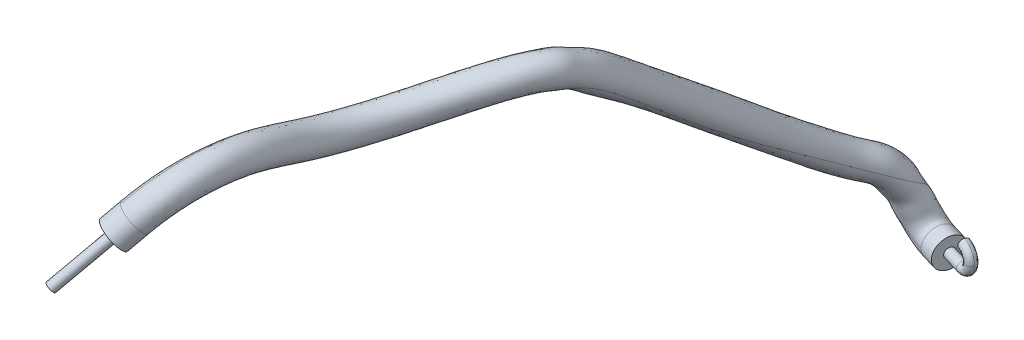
ISO-10303-21;
HEADER;
FILE_DESCRIPTION(('STEP AP214'),'2;1');
FILE_NAME('part.step','',(''),(''),'','','');
FILE_SCHEMA(('AUTOMOTIVE_DESIGN { 1 0 10303 214 1 1 1 1 }'));
ENDSEC;
DATA;
#1=APPLICATION_CONTEXT('core data for automotive mechanical design processes');
#2=APPLICATION_PROTOCOL_DEFINITION('international standard','automotive_design',2000,#1);
#3=PRODUCT_CONTEXT('',#1,'mechanical');
#4=PRODUCT('Part','Part','',(#3));
#5=PRODUCT_RELATED_PRODUCT_CATEGORY('part','',(#4));
#6=PRODUCT_DEFINITION_FORMATION('','',#4);
#7=PRODUCT_DEFINITION_CONTEXT('part definition',#1,'design');
#8=PRODUCT_DEFINITION('design','',#6,#7);
#9=PRODUCT_DEFINITION_SHAPE('','',#8);
#10=(LENGTH_UNIT() NAMED_UNIT(*) SI_UNIT(.MILLI.,.METRE.));
#11=(NAMED_UNIT(*) PLANE_ANGLE_UNIT() SI_UNIT($,.RADIAN.));
#12=(NAMED_UNIT(*) SI_UNIT($,.STERADIAN.) SOLID_ANGLE_UNIT());
#13=UNCERTAINTY_MEASURE_WITH_UNIT(LENGTH_MEASURE(1.E-05),#10,'distance_accuracy_value','');
#14=(GEOMETRIC_REPRESENTATION_CONTEXT(3) GLOBAL_UNCERTAINTY_ASSIGNED_CONTEXT((#13)) GLOBAL_UNIT_ASSIGNED_CONTEXT((#10,
#11,#12)) REPRESENTATION_CONTEXT('',''));
#15=CARTESIAN_POINT('',(0.,0.,0.));
#16=DIRECTION('',(0.,0.,1.));
#17=DIRECTION('',(1.,0.,0.));
#18=AXIS2_PLACEMENT_3D('',#15,#16,#17);
#19=CARTESIAN_POINT('',(-13.62070651,59.58278314,32.204603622));
#20=DIRECTION('',(-0.439842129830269,-0.670380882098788,0.597602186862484));
#21=DIRECTION('',(0.,-0.66542562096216,-0.746464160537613));
#22=AXIS2_PLACEMENT_3D('',#19,#20,#21);
#23=PLANE('',#22);
#24=CARTESIAN_POINT('',(-13.3934935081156,59.3313638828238,32.0897967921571));
#25=DIRECTION('',(0.439842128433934,0.6703808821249,-0.597602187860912));
#26=DIRECTION('',(0.,0.66542562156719,0.746464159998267));
#27=AXIS2_PLACEMENT_3D('',#24,#25,#26);
#28=CIRCLE('',#27,0.249999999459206);
#29=CARTESIAN_POINT('',(-13.3934935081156,59.4977202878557,32.276412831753));
#30=VERTEX_POINT('',#29);
#31=EDGE_CURVE('E22',#30,#30,#28,.F.);
#32=ORIENTED_EDGE('',*,*,#31,.T.);
#33=EDGE_LOOP('',(#32));
#34=FACE_BOUND('',#33,.T.);
#35=ADVANCED_FACE('F17',(#34),#23,.T.);
#36=CARTESIAN_POINT('',(-13.3934935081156,59.3313638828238,32.0897967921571));
#37=DIRECTION('',(0.439842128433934,0.6703808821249,-0.597602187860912));
#38=DIRECTION('',(0.,0.66542562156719,0.746464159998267));
#39=AXIS2_PLACEMENT_3D('',#36,#37,#38);
#40=CYLINDRICAL_SURFACE('',#39,0.249999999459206);
#41=ORIENTED_EDGE('',*,*,#31,.F.);
#42=EDGE_LOOP('',(#41));
#43=FACE_BOUND('',#42,.T.);
#44=CARTESIAN_POINT('',(-12.0739671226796,61.3425065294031,30.296990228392));
#45=DIRECTION('',(0.439842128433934,0.6703808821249,-0.597602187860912));
#46=DIRECTION('',(0.,0.66542562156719,0.746464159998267));
#47=AXIS2_PLACEMENT_3D('',#44,#45,#46);
#48=CIRCLE('',#47,0.249999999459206);
#49=CARTESIAN_POINT('',(-12.0739671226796,61.508862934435,30.4836062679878));
#50=VERTEX_POINT('',#49);
#51=EDGE_CURVE('E96',#50,#50,#48,.F.);
#52=ORIENTED_EDGE('',*,*,#51,.T.);
#53=EDGE_LOOP('',(#52));
#54=FACE_BOUND('',#53,.T.);
#55=ADVANCED_FACE('F244',(#43,#54),#40,.T.);
#56=CARTESIAN_POINT('',(-11.88022137,61.971360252,31.145027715));
#57=DIRECTION('',(0.439842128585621,0.670380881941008,-0.597602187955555));
#58=DIRECTION('',(0.494444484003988,-0.736257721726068,-0.46200564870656));
#59=AXIS2_PLACEMENT_3D('',#56,#57,#58);
#60=PLANE('',#59);
#61=ORIENTED_EDGE('',*,*,#51,.F.);
#62=EDGE_LOOP('',(#61));
#63=FACE_BOUND('',#62,.T.);
#64=CARTESIAN_POINT('',(-12.0739671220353,61.3425065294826,30.2969902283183));
#65=DIRECTION('',(-0.439842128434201,-0.6703808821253,0.597602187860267));
#66=DIRECTION('',(0.,-0.665425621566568,-0.746464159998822));
#67=AXIS2_PLACEMENT_3D('',#64,#65,#66);
#68=CIRCLE('',#67,0.75000000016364);
#69=CARTESIAN_POINT('',(-12.0739671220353,60.8434373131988,29.737142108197));
#70=VERTEX_POINT('',#69);
#71=EDGE_CURVE('E75',#70,#70,#68,.T.);
#72=ORIENTED_EDGE('',*,*,#71,.T.);
#73=EDGE_LOOP('',(#72));
#74=FACE_BOUND('',#73,.T.);
#75=ADVANCED_FACE('F246',(#63,#74),#60,.F.);
#76=CARTESIAN_POINT('',(-11.6341249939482,62.012887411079,29.6993880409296));
#77=DIRECTION('',(-0.439842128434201,-0.6703808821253,0.597602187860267));
#78=DIRECTION('',(0.,-0.665425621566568,-0.746464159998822));
#79=AXIS2_PLACEMENT_3D('',#76,#77,#78);
#80=CYLINDRICAL_SURFACE('',#79,0.75000000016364);
#81=ORIENTED_EDGE('',*,*,#71,.F.);
#82=EDGE_LOOP('',(#81));
#83=FACE_BOUND('',#82,.T.);
#84=CARTESIAN_POINT('',(-11.634124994,62.012887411,29.6993880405));
#85=DIRECTION('',(-0.43984212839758,-0.670380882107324,0.597602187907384));
#86=DIRECTION('',(0.,-0.665425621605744,-0.746464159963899));
#87=AXIS2_PLACEMENT_3D('',#84,#85,#86);
#88=CIRCLE('',#87,0.749999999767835);
#89=CARTESIAN_POINT('',(-11.2632916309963,61.4606941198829,29.3528838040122));
#90=VERTEX_POINT('',#89);
#91=CARTESIAN_POINT('',(-11.634124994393,62.5119566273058,30.2592361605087));
#92=VERTEX_POINT('',#91);
#93=EDGE_CURVE('E69',#90,#92,#88,.T.);
#94=ORIENTED_EDGE('',*,*,#93,.T.);
#95=CARTESIAN_POINT('',(-11.6341249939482,62.012887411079,29.6993880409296));
#96=DIRECTION('',(-0.439842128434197,-0.670380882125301,0.597602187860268));
#97=DIRECTION('',(-6.90882536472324E-11,-0.66542562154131,-0.746464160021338));
#98=AXIS2_PLACEMENT_3D('',#95,#96,#97);
#99=CIRCLE('',#98,0.749999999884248);
#100=CARTESIAN_POINT('',(-12.0049583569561,62.5650807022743,30.0458922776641));
#101=VERTEX_POINT('',#100);
#102=EDGE_CURVE('E70',#101,#92,#99,.F.);
#103=ORIENTED_EDGE('',*,*,#102,.F.);
#104=CARTESIAN_POINT('',(-11.6341249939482,62.012887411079,29.6993880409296));
#105=DIRECTION('',(-0.439842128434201,-0.6703808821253,0.597602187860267));
#106=DIRECTION('',(0.,-0.665425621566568,-0.746464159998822));
#107=AXIS2_PLACEMENT_3D('',#104,#105,#106);
#108=CIRCLE('',#107,0.75000000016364);
#109=EDGE_CURVE('E65',#101,#90,#108,.T.);
#110=ORIENTED_EDGE('',*,*,#109,.T.);
#111=EDGE_LOOP('',(#94,#103,#110));
#112=FACE_BOUND('',#111,.T.);
#113=ADVANCED_FACE('F67',(#83,#112),#80,.T.);
#114=CARTESIAN_POINT('',(-1.886410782,50.644767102,-1.243295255));
#115=CARTESIAN_POINT('',(-1.968521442,50.650525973,-1.263767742));
#116=CARTESIAN_POINT('',(-2.164274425,50.698482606,-1.307429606));
#117=CARTESIAN_POINT('',(-2.395307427,50.804358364,-1.341371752));
#118=CARTESIAN_POINT('',(-2.60002574,50.958180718,-1.353450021));
#119=CARTESIAN_POINT('',(-2.764043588,51.145470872,-1.341487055));
#120=CARTESIAN_POINT('',(-2.889957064,51.359684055,-1.308995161));
#121=CARTESIAN_POINT('',(-3.038226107,51.745795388,-1.215105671));
#122=CARTESIAN_POINT('',(-3.054058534,52.391035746,-1.037295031));
#123=CARTESIAN_POINT('',(-2.657574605,53.119943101,0.027679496));
#124=CARTESIAN_POINT('',(-2.939590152,53.507335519,0.666316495));
#125=CARTESIAN_POINT('',(-3.258043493,53.855859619,1.285390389));
#126=CARTESIAN_POINT('',(-3.406377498,53.994100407,1.543505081));
#127=CARTESIAN_POINT('',(-3.762232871,54.498445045,2.368195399));
#128=CARTESIAN_POINT('',(-4.2177831,55.259491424,3.595532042));
#129=CARTESIAN_POINT('',(-5.305234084,56.958877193,6.503265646));
#130=CARTESIAN_POINT('',(-6.16409283,59.354108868,9.521605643));
#131=CARTESIAN_POINT('',(-6.332374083,61.055563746,11.57068465));
#132=CARTESIAN_POINT('',(-6.617683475,61.556587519,12.617111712));
#133=CARTESIAN_POINT('',(-7.01101853,61.539806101,13.180845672));
#134=CARTESIAN_POINT('',(-7.193153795,61.610985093,13.578655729));
#135=CARTESIAN_POINT('',(-7.32198001,61.699015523,13.953358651));
#136=CARTESIAN_POINT('',(-7.538863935,61.708319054,14.519593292));
#137=CARTESIAN_POINT('',(-8.112263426,61.634596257,16.011469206));
#138=CARTESIAN_POINT('',(-9.277087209,61.046386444,17.622369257));
#139=CARTESIAN_POINT('',(-9.960297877,61.006824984,19.803813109));
#140=CARTESIAN_POINT('',(-10.226645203,61.105727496,20.99034474));
#141=CARTESIAN_POINT('',(-10.328455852,61.311084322,21.972941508));
#142=CARTESIAN_POINT('',(-10.363296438,61.57320866,22.890906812));
#143=CARTESIAN_POINT('',(-10.347622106,61.876946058,23.765989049));
#144=CARTESIAN_POINT('',(-10.292472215,62.164861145,24.621700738));
#145=CARTESIAN_POINT('',(-10.302037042,62.396826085,25.651947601));
#146=CARTESIAN_POINT('',(-10.396533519,62.480983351,26.544433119));
#147=CARTESIAN_POINT('',(-10.540196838,62.41176999,27.541449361));
#148=CARTESIAN_POINT('',(-10.703305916,62.24714593,28.22390293));
#149=CARTESIAN_POINT('',(-10.941106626,61.933818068,28.848861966));
#150=CARTESIAN_POINT('',(-11.125176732,61.671200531,29.165230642));
#151=CARTESIAN_POINT('',(-11.263291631,61.46069412,29.352883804));
#152=CARTESIAN_POINT('',(-1.787593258,52.141305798,-1.218657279));
#153=CARTESIAN_POINT('',(-1.830755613,52.14433301,-1.229418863));
#154=CARTESIAN_POINT('',(-1.774539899,52.157408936,-1.180637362));
#155=CARTESIAN_POINT('',(-1.742076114,52.151159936,-1.149151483));
#156=CARTESIAN_POINT('',(-1.680865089,52.131047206,-1.102398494));
#157=CARTESIAN_POINT('',(-1.65076935,52.119187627,-1.05325366));
#158=CARTESIAN_POINT('',(-1.641892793,52.138497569,-0.984042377));
#159=CARTESIAN_POINT('',(-1.666554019,52.22574009,-0.809651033));
#160=CARTESIAN_POINT('',(-1.562469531,52.526239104,-0.338630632));
#161=CARTESIAN_POINT('',(-2.459759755,52.327405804,1.667353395));
#162=CARTESIAN_POINT('',(-3.190304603,52.409334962,1.702648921));
#163=CARTESIAN_POINT('',(-3.662047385,52.554964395,1.930124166));
#164=CARTESIAN_POINT('',(-3.691969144,52.667746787,2.177374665));
#165=CARTESIAN_POINT('',(-3.995436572,53.183100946,3.05697991));
#166=CARTESIAN_POINT('',(-4.643117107,54.013147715,4.397417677));
#167=CARTESIAN_POINT('',(-6.462574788,55.972968,6.892387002));
#168=CARTESIAN_POINT('',(-7.227574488,58.475208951,9.960585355));
#169=CARTESIAN_POINT('',(-6.999909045,59.726745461,12.341897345));
#170=CARTESIAN_POINT('',(-7.518258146,60.438676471,13.124430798));
#171=CARTESIAN_POINT('',(-8.389478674,60.913287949,13.201476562));
#172=CARTESIAN_POINT('',(-8.615415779,61.103311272,13.316997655));
#173=CARTESIAN_POINT('',(-8.63642952,61.169689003,13.491715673));
#174=CARTESIAN_POINT('',(-8.784852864,61.140132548,13.879831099));
#175=CARTESIAN_POINT('',(-9.037691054,60.7335851,15.193777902));
#176=CARTESIAN_POINT('',(-10.445525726,60.380904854,16.898287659));
#177=CARTESIAN_POINT('',(-11.198224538,60.217170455,19.470237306));
#178=CARTESIAN_POINT('',(-11.509812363,60.32330991,20.883843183));
#179=CARTESIAN_POINT('',(-11.621848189,60.550321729,22.057377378));
#180=CARTESIAN_POINT('',(-11.662820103,60.856456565,23.113992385));
#181=CARTESIAN_POINT('',(-11.648187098,61.197575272,24.076003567));
#182=CARTESIAN_POINT('',(-11.576539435,61.424574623,24.873549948));
#183=CARTESIAN_POINT('',(-11.610827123,61.672338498,25.769199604));
#184=CARTESIAN_POINT('',(-11.777936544,61.880047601,26.49111703));
#185=CARTESIAN_POINT('',(-11.909005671,61.852594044,27.241250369));
#186=CARTESIAN_POINT('',(-12.018523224,61.792068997,27.669205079));
#187=CARTESIAN_POINT('',(-12.229404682,61.525473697,28.122290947));
#188=CARTESIAN_POINT('',(-12.195408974,61.61560158,28.108457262));
#189=CARTESIAN_POINT('',(-12.387855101,61.322286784,28.369928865));
#190=CARTESIAN_POINT('',(-2.150476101,52.141305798,0.236786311));
#191=CARTESIAN_POINT('',(-2.193638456,52.14433301,0.226024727));
#192=CARTESIAN_POINT('',(-2.052715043,52.113437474,0.294422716));
#193=CARTESIAN_POINT('',(-1.962380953,52.051673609,0.331881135));
#194=CARTESIAN_POINT('',(-1.843742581,51.949722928,0.378904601));
#195=CARTESIAN_POINT('',(-1.790620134,51.850002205,0.416297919));
#196=CARTESIAN_POINT('',(-1.792744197,51.779833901,0.466886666));
#197=CARTESIAN_POINT('',(-1.896806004,51.732354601,0.584582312));
#198=CARTESIAN_POINT('',(-2.136297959,51.797619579,1.025350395));
#199=CARTESIAN_POINT('',(-4.216847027,51.874846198,1.674933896));
#200=CARTESIAN_POINT('',(-4.640636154,52.283890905,1.206038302));
#201=CARTESIAN_POINT('',(-4.956290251,52.579110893,1.209714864));
#202=CARTESIAN_POINT('',(-5.034325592,52.638929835,1.535918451));
#203=CARTESIAN_POINT('',(-5.405101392,53.155844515,2.509788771));
#204=CARTESIAN_POINT('',(-6.068764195,54.135251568,3.843314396));
#205=CARTESIAN_POINT('',(-7.459179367,56.785699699,5.984844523));
#206=CARTESIAN_POINT('',(-8.175119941,59.219113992,9.164120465));
#207=CARTESIAN_POINT('',(-8.50893677,60.146331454,11.740646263));
#208=CARTESIAN_POINT('',(-8.733985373,61.165108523,12.562455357));
#209=CARTESIAN_POINT('',(-8.960785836,62.1737875,12.597163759));
#210=CARTESIAN_POINT('',(-9.029565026,62.501892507,12.852622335));
#211=CARTESIAN_POINT('',(-9.084620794,62.562089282,13.216350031));
#212=CARTESIAN_POINT('',(-9.330402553,62.536854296,13.708559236));
#213=CARTESIAN_POINT('',(-9.984744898,61.913882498,14.991275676));
#214=CARTESIAN_POINT('',(-11.129112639,61.717061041,16.801886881));
#215=CARTESIAN_POINT('',(-11.944327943,61.496238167,19.225771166));
#216=CARTESIAN_POINT('',(-12.252485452,61.59038881,20.576686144));
#217=CARTESIAN_POINT('',(-12.376437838,61.795741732,21.696393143));
#218=CARTESIAN_POINT('',(-12.412448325,62.0933199,22.716284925));
#219=CARTESIAN_POINT('',(-12.391873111,62.433204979,23.664987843));
#220=CARTESIAN_POINT('',(-12.355404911,62.664145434,24.534342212));
#221=CARTESIAN_POINT('',(-12.34199615,62.961973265,25.536951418));
#222=CARTESIAN_POINT('',(-12.363700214,63.262479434,26.36444416));
#223=CARTESIAN_POINT('',(-12.482098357,63.240638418,27.335716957));
#224=CARTESIAN_POINT('',(-12.611682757,63.138405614,27.974931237));
#225=CARTESIAN_POINT('',(-12.862802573,62.808669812,28.616340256));
#226=CARTESIAN_POINT('',(-12.9370757,62.719988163,28.801465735));
#227=CARTESIAN_POINT('',(-13.129521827,62.426673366,29.062937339));
#228=CARTESIAN_POINT('',(-2.249293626,50.644767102,0.212148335));
#229=CARTESIAN_POINT('',(-2.311930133,50.649160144,0.196531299));
#230=CARTESIAN_POINT('',(-2.451487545,50.655145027,0.165377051));
#231=CARTESIAN_POINT('',(-2.613190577,50.704702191,0.140264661));
#232=CARTESIAN_POINT('',(-2.763552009,50.776901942,0.127691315));
#233=CARTESIAN_POINT('',(-2.903720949,50.876273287,0.128107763));
#234=CARTESIAN_POINT('',(-3.040853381,51.001023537,0.141922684));
#235=CARTESIAN_POINT('',(-3.268437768,51.252407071,0.179137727));
#236=CARTESIAN_POINT('',(-3.62790173,51.662417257,0.326682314));
#237=CARTESIAN_POINT('',(-4.414655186,52.667383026,0.035261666));
#238=CARTESIAN_POINT('',(-4.389920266,53.381891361,0.169706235));
#239=CARTESIAN_POINT('',(-4.552287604,53.880006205,0.564980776));
#240=CARTESIAN_POINT('',(-4.748734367,53.965283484,0.902048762));
#241=CARTESIAN_POINT('',(-5.17189732,54.471188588,1.821004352));
#242=CARTESIAN_POINT('',(-5.643430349,55.381595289,3.04142872));
#243=CARTESIAN_POINT('',(-6.301838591,57.771608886,5.595723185));
#244=CARTESIAN_POINT('',(-7.111638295,60.09801391,8.72514075));
#245=CARTESIAN_POINT('',(-7.841401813,61.475149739,10.969433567));
#246=CARTESIAN_POINT('',(-7.833410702,62.283019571,12.055136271));
#247=CARTESIAN_POINT('',(-7.582325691,62.800305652,12.576532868));
#248=CARTESIAN_POINT('',(-7.607303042,63.009566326,13.11428041));
#249=CARTESIAN_POINT('',(-7.770171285,63.091415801,13.67799301));
#250=CARTESIAN_POINT('',(-8.084413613,63.10504082,14.348321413));
#251=CARTESIAN_POINT('',(-9.059317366,62.814893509,15.808967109));
#252=CARTESIAN_POINT('',(-9.960673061,62.38254425,17.525967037));
#253=CARTESIAN_POINT('',(-10.706402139,62.285891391,19.559348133));
#254=CARTESIAN_POINT('',(-10.969314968,62.372811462,20.683183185));
#255=CARTESIAN_POINT('',(-11.083054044,62.556491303,21.61196888));
#256=CARTESIAN_POINT('',(-11.112912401,62.810090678,22.493182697));
#257=CARTESIAN_POINT('',(-11.091281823,63.112615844,23.354937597));
#258=CARTESIAN_POINT('',(-11.071426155,63.404297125,24.282613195));
#259=CARTESIAN_POINT('',(-11.033149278,63.686547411,25.419622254));
#260=CARTESIAN_POINT('',(-10.981787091,63.864192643,26.417067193));
#261=CARTESIAN_POINT('',(-11.114173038,63.798467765,27.637116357));
#262=CARTESIAN_POINT('',(-11.293093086,63.598622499,28.525047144));
#263=CARTESIAN_POINT('',(-11.587110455,63.197800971,29.36003864));
#264=CARTESIAN_POINT('',(-11.839677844,62.816991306,29.821329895));
#265=CARTESIAN_POINT('',(-12.004958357,62.565080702,30.045892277));
#266=(BOUNDED_SURFACE() B_SPLINE_SURFACE(3,3,((#114,#115,#116,#117,#118,#119,#120,#121,#122,
#123,#124,#125,#126,#127,#128,#129,#130,#131,#132,#133,#134,#135,#136,#137,#138,#139,#140,#141,
#142,#143,#144,#145,#146,#147,#148,#149,#150,#151),(#152,#153,#154,#155,#156,#157,#158,#159,
#160,#161,#162,#163,#164,#165,#166,#167,#168,#169,#170,#171,#172,#173,#174,#175,#176,#177,#178,
#179,#180,#181,#182,#183,#184,#185,#186,#187,#188,#189),(#190,#191,#192,#193,#194,#195,#196,
#197,#198,#199,#200,#201,#202,#203,#204,#205,#206,#207,#208,#209,#210,#211,#212,#213,#214,#215,
#216,#217,#218,#219,#220,#221,#222,#223,#224,#225,#226,#227),(#228,#229,#230,#231,#232,#233,
#234,#235,#236,#237,#238,#239,#240,#241,#242,#243,#244,#245,#246,#247,#248,#249,#250,#251,#252,
#253,#254,#255,#256,#257,#258,#259,#260,#261,#262,#263,#264,#265)),.UNSPECIFIED.,.F.,.F.,
.F.) B_SPLINE_SURFACE_WITH_KNOTS((4,4),(4,1,1,1,1,1,1,1,1,1,1,1,1,1,1,1,1,1,1,1,1,1,1,1,1,1,1,1,
1,1,1,1,1,1,1,4),(0.,0.5),(0.,0.0104166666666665,0.0208333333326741,0.0312499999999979,
0.0416666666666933,0.052083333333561,0.0624999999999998,0.09375,0.125,0.175672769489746,0.1775,
0.226196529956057,0.23,0.282500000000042,0.335,0.4175,0.474233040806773,0.499999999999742,
0.53125,0.543747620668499,0.5625,0.59375,0.625,0.750000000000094,0.78125,0.8125,
0.843750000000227,0.851827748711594,0.875,0.901303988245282,0.90625,0.9375,0.953125,0.96875,
0.984375,1.),.UNSPECIFIED.) GEOMETRIC_REPRESENTATION_ITEM() RATIONAL_B_SPLINE_SURFACE(((1.,1.,
1.,1.,1.,1.,1.,1.,1.,1.,1.,1.,1.,1.,1.,1.,1.,1.,1.,1.,1.,1.,1.,1.,1.,1.,1.,1.,1.,1.,1.,1.,1.,1.,
1.,1.,1.,1.),(0.333333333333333,0.333333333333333,0.333333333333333,0.333333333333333,
0.333333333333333,0.333333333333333,0.333333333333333,0.333333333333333,0.333333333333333,
0.333333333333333,0.333333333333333,0.333333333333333,0.333333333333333,0.333333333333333,
0.333333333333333,0.333333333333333,0.333333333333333,0.333333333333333,0.333333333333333,
0.333333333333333,0.333333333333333,0.333333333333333,0.333333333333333,0.333333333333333,
0.333333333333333,0.333333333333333,0.333333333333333,0.333333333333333,0.333333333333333,
0.333333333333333,0.333333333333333,0.333333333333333,0.333333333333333,0.333333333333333,
0.333333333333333,0.333333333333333,0.333333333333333,0.333333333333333),(0.333333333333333,
0.333333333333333,0.333333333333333,0.333333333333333,0.333333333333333,0.333333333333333,
0.333333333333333,0.333333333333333,0.333333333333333,0.333333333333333,0.333333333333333,
0.333333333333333,0.333333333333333,0.333333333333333,0.333333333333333,0.333333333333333,
0.333333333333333,0.333333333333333,0.333333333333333,0.333333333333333,0.333333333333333,
0.333333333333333,0.333333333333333,0.333333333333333,0.333333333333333,0.333333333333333,
0.333333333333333,0.333333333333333,0.333333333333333,0.333333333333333,0.333333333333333,
0.333333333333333,0.333333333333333,0.333333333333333,0.333333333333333,0.333333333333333,
0.333333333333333,0.333333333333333),(1.,1.,1.,1.,1.,1.,1.,1.,1.,1.,1.,1.,1.,1.,1.,1.,1.,1.,1.,
1.,1.,1.,1.,1.,1.,1.,1.,1.,1.,1.,1.,1.,1.,1.,1.,1.,1.,1.))) REPRESENTATION_ITEM('') SURFACE());
#267=CARTESIAN_POINT('',(-2.06785220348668,50.6447671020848,-0.515573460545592));
#268=DIRECTION('',(-0.968056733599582,0.0678951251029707,-0.241363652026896));
#269=DIRECTION('',(0.250673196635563,0.241363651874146,-0.937500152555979));
#270=AXIS2_PLACEMENT_3D('',#267,#268,#269);
#271=CIRCLE('',#270,0.750000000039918);
#272=CARTESIAN_POINT('',(-2.24929362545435,50.6447671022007,0.212148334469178));
#273=VERTEX_POINT('',#272);
#274=CARTESIAN_POINT('',(-1.88641078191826,50.6447671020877,-1.24329525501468));
#275=VERTEX_POINT('',#274);
#276=EDGE_CURVE('E80',#273,#275,#271,.T.);
#277=CARTESIAN_POINT('',(-1.886410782,50.644767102,-1.243295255));
#278=CARTESIAN_POINT('',(-1.968521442,50.650525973,-1.263767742));
#279=CARTESIAN_POINT('',(-2.164274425,50.698482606,-1.307429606));
#280=CARTESIAN_POINT('',(-2.395307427,50.804358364,-1.341371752));
#281=CARTESIAN_POINT('',(-2.60002574,50.958180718,-1.353450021));
#282=CARTESIAN_POINT('',(-2.764043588,51.145470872,-1.341487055));
#283=CARTESIAN_POINT('',(-2.889957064,51.359684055,-1.308995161));
#284=CARTESIAN_POINT('',(-3.038226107,51.745795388,-1.215105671));
#285=CARTESIAN_POINT('',(-3.054058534,52.391035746,-1.037295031));
#286=CARTESIAN_POINT('',(-2.657574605,53.119943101,0.027679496));
#287=CARTESIAN_POINT('',(-2.939590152,53.507335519,0.666316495));
#288=CARTESIAN_POINT('',(-3.258043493,53.855859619,1.285390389));
#289=CARTESIAN_POINT('',(-3.406377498,53.994100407,1.543505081));
#290=CARTESIAN_POINT('',(-3.762232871,54.498445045,2.368195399));
#291=CARTESIAN_POINT('',(-4.2177831,55.259491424,3.595532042));
#292=CARTESIAN_POINT('',(-5.305234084,56.958877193,6.503265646));
#293=CARTESIAN_POINT('',(-6.16409283,59.354108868,9.521605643));
#294=CARTESIAN_POINT('',(-6.332374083,61.055563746,11.57068465));
#295=CARTESIAN_POINT('',(-6.617683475,61.556587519,12.617111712));
#296=CARTESIAN_POINT('',(-7.01101853,61.539806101,13.180845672));
#297=CARTESIAN_POINT('',(-7.193153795,61.610985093,13.578655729));
#298=CARTESIAN_POINT('',(-7.32198001,61.699015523,13.953358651));
#299=CARTESIAN_POINT('',(-7.538863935,61.708319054,14.519593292));
#300=CARTESIAN_POINT('',(-8.112263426,61.634596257,16.011469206));
#301=CARTESIAN_POINT('',(-9.277087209,61.046386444,17.622369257));
#302=CARTESIAN_POINT('',(-9.960297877,61.006824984,19.803813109));
#303=CARTESIAN_POINT('',(-10.226645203,61.105727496,20.99034474));
#304=CARTESIAN_POINT('',(-10.328455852,61.311084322,21.972941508));
#305=CARTESIAN_POINT('',(-10.363296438,61.57320866,22.890906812));
#306=CARTESIAN_POINT('',(-10.347622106,61.876946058,23.765989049));
#307=CARTESIAN_POINT('',(-10.292472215,62.164861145,24.621700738));
#308=CARTESIAN_POINT('',(-10.302037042,62.396826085,25.651947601));
#309=CARTESIAN_POINT('',(-10.396533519,62.480983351,26.544433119));
#310=CARTESIAN_POINT('',(-10.540196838,62.41176999,27.541449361));
#311=CARTESIAN_POINT('',(-10.703305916,62.24714593,28.22390293));
#312=CARTESIAN_POINT('',(-10.941106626,61.933818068,28.848861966));
#313=CARTESIAN_POINT('',(-11.125176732,61.671200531,29.165230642));
#314=CARTESIAN_POINT('',(-11.263291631,61.46069412,29.352883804));
#315=B_SPLINE_CURVE_WITH_KNOTS('',3,(#277,#278,#279,#280,#281,#282,#283,#284,#285,#286,#287,
#288,#289,#290,#291,#292,#293,#294,#295,#296,#297,#298,#299,#300,#301,#302,#303,#304,#305,#306,
#307,#308,#309,#310,#311,#312,#313,#314),.UNSPECIFIED.,.F.,.F.,(4,1,1,1,1,1,1,1,1,1,1,1,1,1,1,1,
1,1,1,1,1,1,1,1,1,1,1,1,1,1,1,1,1,1,1,4),(0.,0.0104166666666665,0.0208333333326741,
0.0312499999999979,0.0416666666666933,0.052083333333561,0.0624999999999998,0.09375,0.125,
0.175672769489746,0.1775,0.226196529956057,0.23,0.282500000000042,0.335,0.4175,
0.474233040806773,0.499999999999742,0.53125,0.543747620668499,0.5625,0.59375,0.625,
0.750000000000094,0.78125,0.8125,0.843750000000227,0.851827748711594,0.875,0.901303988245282,
0.90625,0.9375,0.953125,0.96875,0.984375,1.),.UNSPECIFIED.);
#316=EDGE_CURVE('E74',#275,#90,#315,.T.);
#317=CARTESIAN_POINT('',(-2.249293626,50.644767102,0.212148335));
#318=CARTESIAN_POINT('',(-2.311930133,50.649160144,0.196531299));
#319=CARTESIAN_POINT('',(-2.451487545,50.655145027,0.165377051));
#320=CARTESIAN_POINT('',(-2.613190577,50.704702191,0.140264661));
#321=CARTESIAN_POINT('',(-2.763552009,50.776901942,0.127691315));
#322=CARTESIAN_POINT('',(-2.903720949,50.876273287,0.128107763));
#323=CARTESIAN_POINT('',(-3.040853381,51.001023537,0.141922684));
#324=CARTESIAN_POINT('',(-3.268437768,51.252407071,0.179137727));
#325=CARTESIAN_POINT('',(-3.62790173,51.662417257,0.326682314));
#326=CARTESIAN_POINT('',(-4.414655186,52.667383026,0.035261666));
#327=CARTESIAN_POINT('',(-4.389920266,53.381891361,0.169706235));
#328=CARTESIAN_POINT('',(-4.552287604,53.880006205,0.564980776));
#329=CARTESIAN_POINT('',(-4.748734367,53.965283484,0.902048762));
#330=CARTESIAN_POINT('',(-5.17189732,54.471188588,1.821004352));
#331=CARTESIAN_POINT('',(-5.643430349,55.381595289,3.04142872));
#332=CARTESIAN_POINT('',(-6.301838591,57.771608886,5.595723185));
#333=CARTESIAN_POINT('',(-7.111638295,60.09801391,8.72514075));
#334=CARTESIAN_POINT('',(-7.841401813,61.475149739,10.969433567));
#335=CARTESIAN_POINT('',(-7.833410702,62.283019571,12.055136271));
#336=CARTESIAN_POINT('',(-7.582325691,62.800305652,12.576532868));
#337=CARTESIAN_POINT('',(-7.607303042,63.009566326,13.11428041));
#338=CARTESIAN_POINT('',(-7.770171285,63.091415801,13.67799301));
#339=CARTESIAN_POINT('',(-8.084413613,63.10504082,14.348321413));
#340=CARTESIAN_POINT('',(-9.059317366,62.814893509,15.808967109));
#341=CARTESIAN_POINT('',(-9.960673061,62.38254425,17.525967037));
#342=CARTESIAN_POINT('',(-10.706402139,62.285891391,19.559348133));
#343=CARTESIAN_POINT('',(-10.969314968,62.372811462,20.683183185));
#344=CARTESIAN_POINT('',(-11.083054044,62.556491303,21.61196888));
#345=CARTESIAN_POINT('',(-11.112912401,62.810090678,22.493182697));
#346=CARTESIAN_POINT('',(-11.091281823,63.112615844,23.354937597));
#347=CARTESIAN_POINT('',(-11.071426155,63.404297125,24.282613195));
#348=CARTESIAN_POINT('',(-11.033149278,63.686547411,25.419622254));
#349=CARTESIAN_POINT('',(-10.981787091,63.864192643,26.417067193));
#350=CARTESIAN_POINT('',(-11.114173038,63.798467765,27.637116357));
#351=CARTESIAN_POINT('',(-11.293093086,63.598622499,28.525047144));
#352=CARTESIAN_POINT('',(-11.587110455,63.197800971,29.36003864));
#353=CARTESIAN_POINT('',(-11.839677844,62.816991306,29.821329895));
#354=CARTESIAN_POINT('',(-12.004958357,62.565080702,30.045892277));
#355=B_SPLINE_CURVE_WITH_KNOTS('',3,(#317,#318,#319,#320,#321,#322,#323,#324,#325,#326,#327,
#328,#329,#330,#331,#332,#333,#334,#335,#336,#337,#338,#339,#340,#341,#342,#343,#344,#345,#346,
#347,#348,#349,#350,#351,#352,#353,#354),.UNSPECIFIED.,.F.,.F.,(4,1,1,1,1,1,1,1,1,1,1,1,1,1,1,1,
1,1,1,1,1,1,1,1,1,1,1,1,1,1,1,1,1,1,1,4),(0.,0.0104166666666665,0.0208333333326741,
0.0312499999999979,0.0416666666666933,0.052083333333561,0.0624999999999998,0.09375,0.125,
0.175672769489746,0.1775,0.226196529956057,0.23,0.282500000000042,0.335,0.4175,
0.474233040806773,0.499999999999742,0.53125,0.543747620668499,0.5625,0.59375,0.625,
0.750000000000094,0.78125,0.8125,0.843750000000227,0.851827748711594,0.875,0.901303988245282,
0.90625,0.9375,0.953125,0.96875,0.984375,1.),.UNSPECIFIED.);
#356=EDGE_CURVE('E85',#101,#273,#355,.F.);
#357=ORIENTED_EDGE('',*,*,#276,.T.);
#358=ORIENTED_EDGE('',*,*,#316,.T.);
#359=ORIENTED_EDGE('',*,*,#109,.F.);
#360=ORIENTED_EDGE('',*,*,#356,.T.);
#361=EDGE_LOOP('',(#357,#358,#359,#360));
#362=FACE_BOUND('',#361,.T.);
#363=ADVANCED_FACE('F78',(#362),#266,.F.);
#364=CARTESIAN_POINT('',(-2.249293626,50.644767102,0.212148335));
#365=CARTESIAN_POINT('',(-2.311930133,50.649160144,0.196531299));
#366=CARTESIAN_POINT('',(-2.451487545,50.655145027,0.165377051));
#367=CARTESIAN_POINT('',(-2.613190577,50.704702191,0.140264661));
#368=CARTESIAN_POINT('',(-2.763552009,50.776901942,0.127691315));
#369=CARTESIAN_POINT('',(-2.903720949,50.876273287,0.128107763));
#370=CARTESIAN_POINT('',(-3.040853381,51.001023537,0.141922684));
#371=CARTESIAN_POINT('',(-3.268437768,51.252407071,0.179137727));
#372=CARTESIAN_POINT('',(-3.62790173,51.662417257,0.326682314));
#373=CARTESIAN_POINT('',(-4.414655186,52.667383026,0.035261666));
#374=CARTESIAN_POINT('',(-4.389920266,53.381891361,0.169706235));
#375=CARTESIAN_POINT('',(-4.552287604,53.880006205,0.564980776));
#376=CARTESIAN_POINT('',(-4.748734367,53.965283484,0.902048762));
#377=CARTESIAN_POINT('',(-5.17189732,54.471188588,1.821004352));
#378=CARTESIAN_POINT('',(-5.643430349,55.381595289,3.04142872));
#379=CARTESIAN_POINT('',(-6.301838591,57.771608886,5.595723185));
#380=CARTESIAN_POINT('',(-7.111638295,60.09801391,8.72514075));
#381=CARTESIAN_POINT('',(-7.841401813,61.475149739,10.969433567));
#382=CARTESIAN_POINT('',(-7.833410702,62.283019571,12.055136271));
#383=CARTESIAN_POINT('',(-7.582325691,62.800305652,12.576532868));
#384=CARTESIAN_POINT('',(-7.607303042,63.009566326,13.11428041));
#385=CARTESIAN_POINT('',(-7.770171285,63.091415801,13.67799301));
#386=CARTESIAN_POINT('',(-8.084413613,63.10504082,14.348321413));
#387=CARTESIAN_POINT('',(-9.059317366,62.814893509,15.808967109));
#388=CARTESIAN_POINT('',(-9.960673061,62.38254425,17.525967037));
#389=CARTESIAN_POINT('',(-10.706402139,62.285891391,19.559348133));
#390=CARTESIAN_POINT('',(-10.969314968,62.372811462,20.683183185));
#391=CARTESIAN_POINT('',(-11.083054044,62.556491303,21.61196888));
#392=CARTESIAN_POINT('',(-11.112912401,62.810090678,22.493182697));
#393=CARTESIAN_POINT('',(-11.091281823,63.112615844,23.354937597));
#394=CARTESIAN_POINT('',(-11.071426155,63.404297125,24.282613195));
#395=CARTESIAN_POINT('',(-11.033149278,63.686547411,25.419622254));
#396=CARTESIAN_POINT('',(-10.981787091,63.864192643,26.417067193));
#397=CARTESIAN_POINT('',(-11.114173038,63.798467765,27.637116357));
#398=CARTESIAN_POINT('',(-11.293093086,63.598622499,28.525047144));
#399=CARTESIAN_POINT('',(-11.587110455,63.197800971,29.36003864));
#400=CARTESIAN_POINT('',(-11.839677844,62.816991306,29.821329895));
#401=CARTESIAN_POINT('',(-12.004958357,62.565080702,30.045892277));
#402=CARTESIAN_POINT('',(-2.34811115,49.148228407,0.187510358));
#403=CARTESIAN_POINT('',(-2.43022181,49.153987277,0.167037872));
#404=CARTESIAN_POINT('',(-2.850260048,49.196852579,0.036331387));
#405=CARTESIAN_POINT('',(-3.264000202,49.357730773,-0.051351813));
#406=CARTESIAN_POINT('',(-3.683361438,49.604080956,-0.123521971));
#407=CARTESIAN_POINT('',(-4.016821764,49.902544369,-0.160082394));
#408=CARTESIAN_POINT('',(-4.288962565,50.222213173,-0.183041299));
#409=CARTESIAN_POINT('',(-4.640069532,50.772459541,-0.226306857));
#410=CARTESIAN_POINT('',(-5.119505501,51.527214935,-0.371985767));
#411=CARTESIAN_POINT('',(-4.612463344,53.459919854,-1.604410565));
#412=CARTESIAN_POINT('',(-4.139204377,54.479891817,-0.866625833));
#413=CARTESIAN_POINT('',(-4.148284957,55.180901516,-0.079753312));
#414=CARTESIAN_POINT('',(-4.463143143,55.291637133,0.268179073));
#415=CARTESIAN_POINT('',(-4.938693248,55.786532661,1.132219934));
#416=CARTESIAN_POINT('',(-5.218096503,56.627939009,2.239543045));
#417=CARTESIAN_POINT('',(-5.144497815,58.757518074,5.206601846));
#418=CARTESIAN_POINT('',(-6.048156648,60.976913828,8.286161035));
#419=CARTESIAN_POINT('',(-7.173866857,62.803968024,10.198220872));
#420=CARTESIAN_POINT('',(-6.93283603,63.40093062,11.547817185));
#421=CARTESIAN_POINT('',(-6.203865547,63.426823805,12.555901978));
#422=CARTESIAN_POINT('',(-6.185041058,63.517240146,13.375938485));
#423=CARTESIAN_POINT('',(-6.455721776,63.62074232,14.139635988));
#424=CARTESIAN_POINT('',(-6.838424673,63.673227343,14.98808359));
#425=CARTESIAN_POINT('',(-8.133889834,63.71590452,16.626658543));
#426=CARTESIAN_POINT('',(-8.792233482,63.048027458,18.250047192));
#427=CARTESIAN_POINT('',(-9.468476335,63.075544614,19.8929251));
#428=CARTESIAN_POINT('',(-9.686144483,63.155234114,20.789680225));
#429=CARTESIAN_POINT('',(-9.78967025,63.317240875,21.527544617));
#430=CARTESIAN_POINT('',(-9.813376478,63.526861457,22.27008047));
#431=CARTESIAN_POINT('',(-9.790690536,63.792026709,23.044887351));
#432=CARTESIAN_POINT('',(-9.787447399,64.144448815,24.030884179));
#433=CARTESIAN_POINT('',(-9.724302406,64.411121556,25.302293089));
#434=CARTESIAN_POINT('',(-9.599873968,64.465905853,26.469690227));
#435=CARTESIAN_POINT('',(-9.746247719,64.356297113,27.938515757));
#436=CARTESIAN_POINT('',(-9.974503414,64.058839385,29.075163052));
#437=CARTESIAN_POINT('',(-10.311418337,63.58693213,30.103737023));
#438=CARTESIAN_POINT('',(-10.742279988,62.913994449,30.841194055));
#439=CARTESIAN_POINT('',(-10.880394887,62.703488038,31.028847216));
#440=CARTESIAN_POINT('',(-1.985228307,49.148228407,-1.267933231));
#441=CARTESIAN_POINT('',(-2.106287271,49.156718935,-1.298116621));
#442=CARTESIAN_POINT('',(-2.554008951,49.239556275,-1.43422185));
#443=CARTESIAN_POINT('',(-3.048538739,49.457556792,-1.53359202));
#444=CARTESIAN_POINT('',(-3.51918639,49.78531423,-1.604501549));
#445=CARTESIAN_POINT('',(-3.877317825,50.171754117,-1.629720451));
#446=CARTESIAN_POINT('',(-4.138021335,50.580870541,-1.633947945));
#447=CARTESIAN_POINT('',(-4.409898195,51.265850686,-1.62056031));
#448=CARTESIAN_POINT('',(-4.545647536,52.255832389,-1.735959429));
#449=CARTESIAN_POINT('',(-2.855389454,53.912480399,-1.611994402));
#450=CARTESIAN_POINT('',(-2.688875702,54.605336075,-0.370015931));
#451=CARTESIAN_POINT('',(-2.8540396,55.156754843,0.640656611));
#452=CARTESIAN_POINT('',(-3.120785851,55.320454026,0.909635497));
#453=CARTESIAN_POINT('',(-3.52902917,55.813789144,1.679410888));
#454=CARTESIAN_POINT('',(-3.792449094,56.505835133,2.793646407));
#455=CARTESIAN_POINT('',(-4.147893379,57.944786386,6.114144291));
#456=CARTESIAN_POINT('',(-5.100611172,60.233008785,9.082625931));
#457=CARTESIAN_POINT('',(-5.664839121,62.384382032,10.799471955));
#458=CARTESIAN_POINT('',(-5.717108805,62.674498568,12.109792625));
#459=CARTESIAN_POINT('',(-5.632558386,62.166324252,13.160214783));
#460=CARTESIAN_POINT('',(-5.77089181,62.118658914,13.840313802));
#461=CARTESIAN_POINT('',(-6.0075305,62.228342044,14.415001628));
#462=CARTESIAN_POINT('',(-6.292875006,62.27650556,15.159355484));
#463=CARTESIAN_POINT('',(-7.186835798,62.535607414,16.82916051));
#464=CARTESIAN_POINT('',(-8.108648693,61.711868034,18.346450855));
#465=CARTESIAN_POINT('',(-8.722371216,61.796479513,20.137388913));
#466=CARTESIAN_POINT('',(-8.943478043,61.888145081,21.096846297));
#467=CARTESIAN_POINT('',(-9.035063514,62.071846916,21.888505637));
#468=CARTESIAN_POINT('',(-9.063772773,62.289960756,22.667821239));
#469=CARTESIAN_POINT('',(-9.047057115,62.556316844,23.455974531));
#470=CARTESIAN_POINT('',(-9.008404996,62.905147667,24.369851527));
#471=CARTESIAN_POINT('',(-8.993246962,63.121313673,25.534695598));
#472=CARTESIAN_POINT('',(-9.015130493,63.081919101,26.597749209));
#473=CARTESIAN_POINT('',(-9.171388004,62.970945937,27.841648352));
#474=CARTESIAN_POINT('',(-9.388088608,62.702222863,28.77860078));
#475=CARTESIAN_POINT('',(-9.652808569,62.342162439,29.575432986));
#476=CARTESIAN_POINT('',(-10.05494449,61.726799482,30.222004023));
#477=CARTESIAN_POINT('',(-10.138728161,61.599101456,30.335838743));
#478=CARTESIAN_POINT('',(-1.886410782,50.644767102,-1.243295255));
#479=CARTESIAN_POINT('',(-1.968521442,50.650525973,-1.263767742));
#480=CARTESIAN_POINT('',(-2.164274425,50.698482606,-1.307429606));
#481=CARTESIAN_POINT('',(-2.395307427,50.804358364,-1.341371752));
#482=CARTESIAN_POINT('',(-2.60002574,50.958180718,-1.353450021));
#483=CARTESIAN_POINT('',(-2.764043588,51.145470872,-1.341487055));
#484=CARTESIAN_POINT('',(-2.889957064,51.359684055,-1.308995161));
#485=CARTESIAN_POINT('',(-3.038226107,51.745795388,-1.215105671));
#486=CARTESIAN_POINT('',(-3.054058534,52.391035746,-1.037295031));
#487=CARTESIAN_POINT('',(-2.657574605,53.119943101,0.027679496));
#488=CARTESIAN_POINT('',(-2.939590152,53.507335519,0.666316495));
#489=CARTESIAN_POINT('',(-3.258043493,53.855859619,1.285390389));
#490=CARTESIAN_POINT('',(-3.406377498,53.994100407,1.543505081));
#491=CARTESIAN_POINT('',(-3.762232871,54.498445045,2.368195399));
#492=CARTESIAN_POINT('',(-4.2177831,55.259491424,3.595532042));
#493=CARTESIAN_POINT('',(-5.305234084,56.958877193,6.503265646));
#494=CARTESIAN_POINT('',(-6.16409283,59.354108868,9.521605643));
#495=CARTESIAN_POINT('',(-6.332374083,61.055563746,11.57068465));
#496=CARTESIAN_POINT('',(-6.617683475,61.556587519,12.617111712));
#497=CARTESIAN_POINT('',(-7.01101853,61.539806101,13.180845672));
#498=CARTESIAN_POINT('',(-7.193153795,61.610985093,13.578655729));
#499=CARTESIAN_POINT('',(-7.32198001,61.699015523,13.953358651));
#500=CARTESIAN_POINT('',(-7.538863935,61.708319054,14.519593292));
#501=CARTESIAN_POINT('',(-8.112263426,61.634596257,16.011469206));
#502=CARTESIAN_POINT('',(-9.277087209,61.046386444,17.622369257));
#503=CARTESIAN_POINT('',(-9.960297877,61.006824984,19.803813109));
#504=CARTESIAN_POINT('',(-10.226645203,61.105727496,20.99034474));
#505=CARTESIAN_POINT('',(-10.328455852,61.311084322,21.972941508));
#506=CARTESIAN_POINT('',(-10.363296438,61.57320866,22.890906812));
#507=CARTESIAN_POINT('',(-10.347622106,61.876946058,23.765989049));
#508=CARTESIAN_POINT('',(-10.292472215,62.164861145,24.621700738));
#509=CARTESIAN_POINT('',(-10.302037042,62.396826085,25.651947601));
#510=CARTESIAN_POINT('',(-10.396533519,62.480983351,26.544433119));
#511=CARTESIAN_POINT('',(-10.540196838,62.41176999,27.541449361));
#512=CARTESIAN_POINT('',(-10.703305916,62.24714593,28.22390293));
#513=CARTESIAN_POINT('',(-10.941106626,61.933818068,28.848861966));
#514=CARTESIAN_POINT('',(-11.125176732,61.671200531,29.165230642));
#515=CARTESIAN_POINT('',(-11.263291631,61.46069412,29.352883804));
#516=(BOUNDED_SURFACE() B_SPLINE_SURFACE(3,3,((#364,#365,#366,#367,#368,#369,#370,#371,#372,
#373,#374,#375,#376,#377,#378,#379,#380,#381,#382,#383,#384,#385,#386,#387,#388,#389,#390,#391,
#392,#393,#394,#395,#396,#397,#398,#399,#400,#401),(#402,#403,#404,#405,#406,#407,#408,#409,
#410,#411,#412,#413,#414,#415,#416,#417,#418,#419,#420,#421,#422,#423,#424,#425,#426,#427,#428,
#429,#430,#431,#432,#433,#434,#435,#436,#437,#438,#439),(#440,#441,#442,#443,#444,#445,#446,
#447,#448,#449,#450,#451,#452,#453,#454,#455,#456,#457,#458,#459,#460,#461,#462,#463,#464,#465,
#466,#467,#468,#469,#470,#471,#472,#473,#474,#475,#476,#477),(#478,#479,#480,#481,#482,#483,
#484,#485,#486,#487,#488,#489,#490,#491,#492,#493,#494,#495,#496,#497,#498,#499,#500,#501,#502,
#503,#504,#505,#506,#507,#508,#509,#510,#511,#512,#513,#514,#515)),.UNSPECIFIED.,.F.,.F.,
.F.) B_SPLINE_SURFACE_WITH_KNOTS((4,4),(4,1,1,1,1,1,1,1,1,1,1,1,1,1,1,1,1,1,1,1,1,1,1,1,1,1,1,1,
1,1,1,1,1,1,1,4),(0.5,1.),(0.,0.0104166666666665,0.0208333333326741,0.0312499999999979,
0.0416666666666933,0.052083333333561,0.0624999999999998,0.09375,0.125,0.175672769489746,0.1775,
0.226196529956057,0.23,0.282500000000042,0.335,0.4175,0.474233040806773,0.499999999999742,
0.53125,0.543747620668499,0.5625,0.59375,0.625,0.750000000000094,0.78125,0.8125,
0.843750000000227,0.851827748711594,0.875,0.901303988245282,0.90625,0.9375,0.953125,0.96875,
0.984375,1.),.UNSPECIFIED.) GEOMETRIC_REPRESENTATION_ITEM() RATIONAL_B_SPLINE_SURFACE(((1.,1.,
1.,1.,1.,1.,1.,1.,1.,1.,1.,1.,1.,1.,1.,1.,1.,1.,1.,1.,1.,1.,1.,1.,1.,1.,1.,1.,1.,1.,1.,1.,1.,1.,
1.,1.,1.,1.),(0.333333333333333,0.333333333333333,0.333333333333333,0.333333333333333,
0.333333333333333,0.333333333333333,0.333333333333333,0.333333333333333,0.333333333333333,
0.333333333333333,0.333333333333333,0.333333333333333,0.333333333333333,0.333333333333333,
0.333333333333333,0.333333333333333,0.333333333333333,0.333333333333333,0.333333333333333,
0.333333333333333,0.333333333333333,0.333333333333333,0.333333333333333,0.333333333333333,
0.333333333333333,0.333333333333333,0.333333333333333,0.333333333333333,0.333333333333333,
0.333333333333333,0.333333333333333,0.333333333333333,0.333333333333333,0.333333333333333,
0.333333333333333,0.333333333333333,0.333333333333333,0.333333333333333),(0.333333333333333,
0.333333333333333,0.333333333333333,0.333333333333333,0.333333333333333,0.333333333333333,
0.333333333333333,0.333333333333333,0.333333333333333,0.333333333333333,0.333333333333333,
0.333333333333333,0.333333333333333,0.333333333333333,0.333333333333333,0.333333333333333,
0.333333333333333,0.333333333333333,0.333333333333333,0.333333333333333,0.333333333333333,
0.333333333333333,0.333333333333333,0.333333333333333,0.333333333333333,0.333333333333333,
0.333333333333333,0.333333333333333,0.333333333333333,0.333333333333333,0.333333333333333,
0.333333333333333,0.333333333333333,0.333333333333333,0.333333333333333,0.333333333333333,
0.333333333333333,0.333333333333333),(1.,1.,1.,1.,1.,1.,1.,1.,1.,1.,1.,1.,1.,1.,1.,1.,1.,1.,1.,
1.,1.,1.,1.,1.,1.,1.,1.,1.,1.,1.,1.,1.,1.,1.,1.,1.,1.,1.))) REPRESENTATION_ITEM('') SURFACE());
#517=CARTESIAN_POINT('',(-2.06785220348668,50.6447671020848,-0.515573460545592));
#518=DIRECTION('',(-0.968056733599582,0.0678951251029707,-0.241363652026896));
#519=DIRECTION('',(0.250673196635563,0.241363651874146,-0.937500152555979));
#520=AXIS2_PLACEMENT_3D('',#517,#518,#519);
#521=CIRCLE('',#520,0.750000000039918);
#522=EDGE_CURVE('E209',#275,#273,#521,.T.);
#523=ORIENTED_EDGE('',*,*,#356,.F.);
#524=ORIENTED_EDGE('',*,*,#102,.T.);
#525=ORIENTED_EDGE('',*,*,#93,.F.);
#526=ORIENTED_EDGE('',*,*,#316,.F.);
#527=ORIENTED_EDGE('',*,*,#522,.T.);
#528=EDGE_LOOP('',(#523,#524,#525,#526,#527));
#529=FACE_BOUND('',#528,.T.);
#530=ADVANCED_FACE('F84',(#529),#516,.F.);
#531=CARTESIAN_POINT('',(-1.39021249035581,50.5972405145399,-0.346618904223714));
#532=DIRECTION('',(-0.968056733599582,0.0678951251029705,-0.241363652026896));
#533=DIRECTION('',(-0.241921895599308,0.,0.970295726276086));
#534=AXIS2_PLACEMENT_3D('',#531,#532,#533);
#535=CYLINDRICAL_SURFACE('',#534,0.749999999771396);
#536=ORIENTED_EDGE('',*,*,#522,.F.);
#537=ORIENTED_EDGE('',*,*,#276,.F.);
#538=EDGE_LOOP('',(#536,#537));
#539=FACE_BOUND('',#538,.T.);
#540=CARTESIAN_POINT('',(-1.39021249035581,50.5972405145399,-0.346618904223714));
#541=DIRECTION('',(-0.968056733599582,0.0678951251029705,-0.241363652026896));
#542=DIRECTION('',(-0.241921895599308,0.,0.970295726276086));
#543=AXIS2_PLACEMENT_3D('',#540,#541,#542);
#544=CIRCLE('',#543,0.749999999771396);
#545=CARTESIAN_POINT('',(-1.57165391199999,50.5972405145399,0.381102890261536));
#546=VERTEX_POINT('',#545);
#547=EDGE_CURVE('E216',#546,#546,#544,.F.);
#548=ORIENTED_EDGE('',*,*,#547,.F.);
#549=EDGE_LOOP('',(#548));
#550=FACE_BOUND('',#549,.T.);
#551=ADVANCED_FACE('F261',(#539,#550),#535,.T.);
#552=CARTESIAN_POINT('',(-1.195856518,51.515190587,-0.867920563));
#553=DIRECTION('',(0.96805673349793,-0.067895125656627,0.241363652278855));
#554=DIRECTION('',(-0.250673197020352,-0.24136365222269,0.937500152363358));
#555=AXIS2_PLACEMENT_3D('',#552,#553,#554);
#556=PLANE('',#555);
#557=CARTESIAN_POINT('',(-1.39021249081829,50.5972405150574,-0.346618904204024));
#558=DIRECTION('',(0.968056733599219,-0.0678951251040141,0.241363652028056));
#559=DIRECTION('',(0.241921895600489,0.,-0.970295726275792));
#560=AXIS2_PLACEMENT_3D('',#557,#558,#559);
#561=CIRCLE('',#560,0.250000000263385);
#562=CARTESIAN_POINT('',(-1.32973201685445,50.5972405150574,-0.589192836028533));
#563=VERTEX_POINT('',#562);
#564=EDGE_CURVE('E227',#563,#563,#561,.F.);
#565=ORIENTED_EDGE('',*,*,#564,.T.);
#566=EDGE_LOOP('',(#565));
#567=FACE_BOUND('',#566,.T.);
#568=ORIENTED_EDGE('',*,*,#547,.T.);
#569=EDGE_LOOP('',(#568));
#570=FACE_BOUND('',#569,.T.);
#571=ADVANCED_FACE('F258',(#567,#570),#556,.T.);
#572=CARTESIAN_POINT('',(-1.39021249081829,50.5972405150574,-0.346618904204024));
#573=DIRECTION('',(0.968056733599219,-0.0678951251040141,0.241363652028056));
#574=DIRECTION('',(0.241921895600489,0.,-0.970295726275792));
#575=AXIS2_PLACEMENT_3D('',#572,#573,#574);
#576=CYLINDRICAL_SURFACE('',#575,0.250000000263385);
#577=ORIENTED_EDGE('',*,*,#564,.F.);
#578=EDGE_LOOP('',(#577));
#579=FACE_BOUND('',#578,.T.);
#580=CARTESIAN_POINT('',(-0.541651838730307,50.5377263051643,-0.135048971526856));
#581=DIRECTION('',(0.968056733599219,-0.0678951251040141,0.241363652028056));
#582=DIRECTION('',(0.241921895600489,0.,-0.970295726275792));
#583=AXIS2_PLACEMENT_3D('',#580,#581,#582);
#584=CIRCLE('',#583,0.250000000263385);
#585=CARTESIAN_POINT('',(-0.558121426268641,50.2883031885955,-0.139155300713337));
#586=VERTEX_POINT('',#585);
#587=CARTESIAN_POINT('',(-0.525182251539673,50.7871494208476,-0.130942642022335));
#588=VERTEX_POINT('',#587);
#589=EDGE_CURVE('E232',#586,#588,#584,.T.);
#590=ORIENTED_EDGE('',*,*,#589,.F.);
#591=CARTESIAN_POINT('',(-0.541651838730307,50.5377263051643,-0.135048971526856));
#592=DIRECTION('',(0.968056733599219,-0.0678951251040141,0.241363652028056));
#593=DIRECTION('',(0.241921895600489,0.,-0.970295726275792));
#594=AXIS2_PLACEMENT_3D('',#591,#592,#593);
#595=CIRCLE('',#594,0.250000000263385);
#596=EDGE_CURVE('E273',#588,#586,#595,.T.);
#597=ORIENTED_EDGE('',*,*,#596,.F.);
#598=EDGE_LOOP('',(#590,#597));
#599=FACE_BOUND('',#598,.T.);
#600=ADVANCED_FACE('F260',(#579,#599),#576,.T.);
#601=CARTESIAN_POINT('',(-0.564077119,50.289549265,-0.114917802));
#602=CARTESIAN_POINT('',(-0.102637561,50.25718598,0.000132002));
#603=CARTESIAN_POINT('',(0.2353241,50.582596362,0.084395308));
#604=CARTESIAN_POINT('',(0.2353241,51.059262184,0.084395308));
#605=CARTESIAN_POINT('',(-0.527005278,50.273778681,-0.268041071));
#606=CARTESIAN_POINT('',(-0.056111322,50.240752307,-0.150634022));
#607=CARTESIAN_POINT('',(0.288774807,50.572829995,-0.064644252));
#608=CARTESIAN_POINT('',(0.288774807,51.059262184,-0.064644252));
#609=CARTESIAN_POINT('',(-0.491602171,50.37975731,-0.380223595));
#610=CARTESIAN_POINT('',(-0.084241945,50.351186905,-0.278657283));
#611=CARTESIAN_POINT('',(0.214111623,50.638460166,-0.204269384));
#612=CARTESIAN_POINT('',(0.214111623,51.059262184,-0.204269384));
#613=CARTESIAN_POINT('',(-0.481171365,50.537726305,-0.377622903));
#614=CARTESIAN_POINT('',(-0.168512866,50.51579785,-0.299668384));
#615=CARTESIAN_POINT('',(0.060480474,50.736286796,-0.242573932));
#616=CARTESIAN_POINT('',(0.060480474,51.059262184,-0.242573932));
#617=CARTESIAN_POINT('',(-0.470740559,50.695695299,-0.375022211));
#618=CARTESIAN_POINT('',(-0.252783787,50.680408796,-0.320679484));
#619=CARTESIAN_POINT('',(-0.093150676,50.834113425,-0.280878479));
#620=CARTESIAN_POINT('',(-0.093150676,51.059262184,-0.280878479));
#621=CARTESIAN_POINT('',(-0.492147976,50.801673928,-0.25935017));
#622=CARTESIAN_POINT('',(-0.337724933,50.790843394,-0.220848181));
#623=CARTESIAN_POINT('',(-0.224624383,50.899743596,-0.192649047));
#624=CARTESIAN_POINT('',(-0.224624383,51.059262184,-0.192649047));
#625=CARTESIAN_POINT('',(-0.531302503,50.785903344,-0.106746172));
#626=CARTESIAN_POINT('',(-0.367425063,50.774409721,-0.065886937));
#627=CARTESIAN_POINT('',(-0.247400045,50.88997723,-0.035961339));
#628=CARTESIAN_POINT('',(-0.247400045,51.059262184,-0.035961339));
#629=(BOUNDED_SURFACE() B_SPLINE_SURFACE(3,3,((#601,#602,#603,#604),(#605,#606,#607,#608),(#609,
#610,#611,#612),(#613,#614,#615,#616),(#617,#618,#619,#620),(#621,#622,#623,#624),(#625,#626,
#627,#628)),.UNSPECIFIED.,.F.,.F.,.F.) B_SPLINE_SURFACE_WITH_KNOTS((4,3,4),(4,4),(0.,0.5,1.),
(0.,1.),.UNSPECIFIED.) GEOMETRIC_REPRESENTATION_ITEM() RATIONAL_B_SPLINE_SURFACE(((1.,
0.788453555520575,0.788453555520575,1.),(0.780588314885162,0.615457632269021,0.615457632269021,
0.780588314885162),(0.780588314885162,0.615457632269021,0.615457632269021,0.780588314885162),
(1.,0.788453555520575,0.788453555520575,1.),(0.780588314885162,0.615457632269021,
0.615457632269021,0.780588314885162),(0.780588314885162,0.615457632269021,0.615457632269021,
0.780588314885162),(1.,0.788453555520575,0.788453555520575,1.))) REPRESENTATION_ITEM('') SURFACE());
#630=CARTESIAN_POINT('',(-0.24257393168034,51.059262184,-0.0604804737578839));
#631=CARTESIAN_POINT('',(-0.24257393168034,50.8907488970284,-0.0604804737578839));
#632=CARTESIAN_POINT('',(-0.362051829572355,50.7757081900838,-0.0902696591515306));
#633=CARTESIAN_POINT('',(-0.52518225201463,50.7871494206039,-0.130942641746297));
#634=(BOUNDED_CURVE() B_SPLINE_CURVE(3,(#630,#631,#632,#633),.UNSPECIFIED.,.F.,
.F.) B_SPLINE_CURVE_WITH_KNOTS((4,4),(0.,1.),
.UNSPECIFIED.) CURVE() GEOMETRIC_REPRESENTATION_ITEM() RATIONAL_B_SPLINE_CURVE((0.959415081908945,
0.756454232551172,0.756454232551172,0.959415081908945)) REPRESENTATION_ITEM(''));
#635=CARTESIAN_POINT('',(-0.242573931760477,51.059262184,-0.0604804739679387));
#636=VERTEX_POINT('',#635);
#637=EDGE_CURVE('E164',#636,#588,#634,.T.);
#638=CARTESIAN_POINT('',(0.2353241,51.059262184,0.084395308));
#639=CARTESIAN_POINT('',(0.288774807,51.059262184,-0.064644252));
#640=CARTESIAN_POINT('',(0.214111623,51.059262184,-0.204269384));
#641=CARTESIAN_POINT('',(0.060480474,51.059262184,-0.242573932));
#642=CARTESIAN_POINT('',(-0.093150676,51.059262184,-0.280878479));
#643=CARTESIAN_POINT('',(-0.224624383,51.059262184,-0.192649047));
#644=CARTESIAN_POINT('',(-0.247400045,51.059262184,-0.035961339));
#645=(BOUNDED_CURVE() B_SPLINE_CURVE(3,(#638,#639,#640,#641,#642,#643,#644),.UNSPECIFIED.,.F.,
.F.) B_SPLINE_CURVE_WITH_KNOTS((4,3,4),(0.,0.5,1.),
.UNSPECIFIED.) CURVE() GEOMETRIC_REPRESENTATION_ITEM() RATIONAL_B_SPLINE_CURVE((1.,
0.780588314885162,0.780588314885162,1.,0.780588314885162,0.780588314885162,1.)) REPRESENTATION_ITEM(''));
#646=CARTESIAN_POINT('',(0.242573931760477,51.059262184,0.0604804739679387));
#647=VERTEX_POINT('',#646);
#648=EDGE_CURVE('E275',#647,#636,#645,.T.);
#649=CARTESIAN_POINT('',(-0.558121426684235,50.2883031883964,-0.139155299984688));
#650=CARTESIAN_POINT('',(-0.0959348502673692,50.255887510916,-0.0239192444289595));
#651=CARTESIAN_POINT('',(0.242573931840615,50.5818246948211,0.0604804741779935));
#652=CARTESIAN_POINT('',(0.242573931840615,51.059262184,0.0604804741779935));
#653=(BOUNDED_CURVE() B_SPLINE_CURVE(3,(#649,#650,#651,#652),.UNSPECIFIED.,.F.,
.F.) B_SPLINE_CURVE_WITH_KNOTS((4,4),(0.,1.),
.UNSPECIFIED.) CURVE() GEOMETRIC_REPRESENTATION_ITEM() RATIONAL_B_SPLINE_CURVE((0.959415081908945,
0.756454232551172,0.756454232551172,0.959415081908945)) REPRESENTATION_ITEM(''));
#654=EDGE_CURVE('E205',#586,#647,#653,.T.);
#655=ORIENTED_EDGE('',*,*,#637,.F.);
#656=ORIENTED_EDGE('',*,*,#648,.F.);
#657=ORIENTED_EDGE('',*,*,#654,.F.);
#658=ORIENTED_EDGE('',*,*,#589,.T.);
#659=EDGE_LOOP('',(#655,#656,#657,#658));
#660=FACE_BOUND('',#659,.T.);
#661=ADVANCED_FACE('F180',(#660),#629,.T.);
#662=CARTESIAN_POINT('',(-0.519226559,50.785903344,-0.155180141));
#663=CARTESIAN_POINT('',(-0.355349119,50.774409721,-0.114320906));
#664=CARTESIAN_POINT('',(-0.2353241,50.88997723,-0.084395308));
#665=CARTESIAN_POINT('',(-0.2353241,51.059262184,-0.084395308));
#666=CARTESIAN_POINT('',(-0.5562984,50.801673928,-0.002056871));
#667=CARTESIAN_POINT('',(-0.401875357,50.790843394,0.036445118));
#668=CARTESIAN_POINT('',(-0.288774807,50.899743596,0.064644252));
#669=CARTESIAN_POINT('',(-0.288774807,51.059262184,0.064644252));
#670=CARTESIAN_POINT('',(-0.591701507,50.695695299,0.110125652));
#671=CARTESIAN_POINT('',(-0.373744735,50.680408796,0.164468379));
#672=CARTESIAN_POINT('',(-0.214111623,50.834113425,0.204269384));
#673=CARTESIAN_POINT('',(-0.214111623,51.059262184,0.204269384));
#674=CARTESIAN_POINT('',(-0.602132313,50.537726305,0.10752496));
#675=CARTESIAN_POINT('',(-0.289473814,50.51579785,0.185479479));
#676=CARTESIAN_POINT('',(-0.060480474,50.736286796,0.242573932));
#677=CARTESIAN_POINT('',(-0.060480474,51.059262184,0.242573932));
#678=CARTESIAN_POINT('',(-0.612563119,50.37975731,0.104924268));
#679=CARTESIAN_POINT('',(-0.205202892,50.351186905,0.20649058));
#680=CARTESIAN_POINT('',(0.093150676,50.638460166,0.280878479));
#681=CARTESIAN_POINT('',(0.093150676,51.059262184,0.280878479));
#682=CARTESIAN_POINT('',(-0.591155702,50.273778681,-0.010747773));
#683=CARTESIAN_POINT('',(-0.120261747,50.240752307,0.106659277));
#684=CARTESIAN_POINT('',(0.224624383,50.572829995,0.192649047));
#685=CARTESIAN_POINT('',(0.224624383,51.059262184,0.192649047));
#686=CARTESIAN_POINT('',(-0.552001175,50.289549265,-0.16335177));
#687=CARTESIAN_POINT('',(-0.090561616,50.25718598,-0.048301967));
#688=CARTESIAN_POINT('',(0.247400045,50.582596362,0.035961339));
#689=CARTESIAN_POINT('',(0.247400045,51.059262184,0.035961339));
#690=(BOUNDED_SURFACE() B_SPLINE_SURFACE(3,3,((#662,#663,#664,#665),(#666,#667,#668,#669),(#670,
#671,#672,#673),(#674,#675,#676,#677),(#678,#679,#680,#681),(#682,#683,#684,#685),(#686,#687,
#688,#689)),.UNSPECIFIED.,.F.,.F.,.F.) B_SPLINE_SURFACE_WITH_KNOTS((4,3,4),(4,4),(0.,0.5,1.),
(0.,1.),.UNSPECIFIED.) GEOMETRIC_REPRESENTATION_ITEM() RATIONAL_B_SPLINE_SURFACE(((1.,
0.788453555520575,0.788453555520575,1.),(0.780588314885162,0.615457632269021,0.615457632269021,
0.780588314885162),(0.780588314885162,0.615457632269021,0.615457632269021,0.780588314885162),
(1.,0.788453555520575,0.788453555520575,1.),(0.780588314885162,0.615457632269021,
0.615457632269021,0.780588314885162),(0.780588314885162,0.615457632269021,0.615457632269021,
0.780588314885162),(1.,0.788453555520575,0.788453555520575,1.))) REPRESENTATION_ITEM('') SURFACE());
#691=CARTESIAN_POINT('',(-0.2353241,51.059262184,-0.084395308));
#692=CARTESIAN_POINT('',(-0.288774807,51.059262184,0.064644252));
#693=CARTESIAN_POINT('',(-0.214111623,51.059262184,0.204269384));
#694=CARTESIAN_POINT('',(-0.060480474,51.059262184,0.242573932));
#695=CARTESIAN_POINT('',(0.093150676,51.059262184,0.280878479));
#696=CARTESIAN_POINT('',(0.224624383,51.059262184,0.192649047));
#697=CARTESIAN_POINT('',(0.247400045,51.059262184,0.035961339));
#698=(BOUNDED_CURVE() B_SPLINE_CURVE(3,(#691,#692,#693,#694,#695,#696,#697),.UNSPECIFIED.,.F.,
.F.) B_SPLINE_CURVE_WITH_KNOTS((4,3,4),(0.,0.5,1.),
.UNSPECIFIED.) CURVE() GEOMETRIC_REPRESENTATION_ITEM() RATIONAL_B_SPLINE_CURVE((1.,
0.780588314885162,0.780588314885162,1.,0.780588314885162,0.780588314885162,1.)) REPRESENTATION_ITEM(''));
#699=EDGE_CURVE('E286',#636,#647,#698,.T.);
#700=ORIENTED_EDGE('',*,*,#637,.T.);
#701=ORIENTED_EDGE('',*,*,#596,.T.);
#702=ORIENTED_EDGE('',*,*,#654,.T.);
#703=ORIENTED_EDGE('',*,*,#699,.F.);
#704=EDGE_LOOP('',(#700,#701,#702,#703));
#705=FACE_BOUND('',#704,.T.);
#706=ADVANCED_FACE('F169',(#705),#690,.T.);
#707=CARTESIAN_POINT('',(-0.43884617,51.273917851,-0.299336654));
#708=DIRECTION('',(-0.964028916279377,0.113470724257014,-0.24035940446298));
#709=DIRECTION('',(-0.208100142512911,0.240359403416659,0.94811480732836));
#710=AXIS2_PLACEMENT_3D('',#707,#708,#709);
#711=PLANE('',#710);
#712=CARTESIAN_POINT('',(-0.422135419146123,51.8270134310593,-0.105250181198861));
#713=CARTESIAN_POINT('',(-0.425536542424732,51.8270252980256,-0.091603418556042));
#714=CARTESIAN_POINT('',(-0.429070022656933,51.8258349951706,-0.0779933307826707));
#715=CARTESIAN_POINT('',(-0.436295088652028,51.8211374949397,-0.0512328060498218));
#716=CARTESIAN_POINT('',(-0.43998655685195,51.8176319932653,-0.0380820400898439));
#717=CARTESIAN_POINT('',(-0.447427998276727,51.8083891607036,-0.01259947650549));
#718=CARTESIAN_POINT('',(-0.451177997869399,51.8026507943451,-0.00026806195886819));
#719=CARTESIAN_POINT('',(-0.458627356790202,51.7891102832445,0.0232173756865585));
#720=CARTESIAN_POINT('',(-0.462326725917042,51.7813085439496,0.0343716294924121));
#721=CARTESIAN_POINT('',(-0.469568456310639,51.7638665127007,0.0551824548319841));
#722=CARTESIAN_POINT('',(-0.473110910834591,51.7542273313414,0.0648399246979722));
#723=CARTESIAN_POINT('',(-0.479945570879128,51.7333661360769,0.0824039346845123));
#724=CARTESIAN_POINT('',(-0.483237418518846,51.7221419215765,0.090308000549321));
#725=CARTESIAN_POINT('',(-0.48946745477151,51.6984563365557,0.104113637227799));
#726=CARTESIAN_POINT('',(-0.492406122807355,51.6859966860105,0.11001794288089));
#727=CARTESIAN_POINT('',(-0.49785544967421,51.6601630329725,0.119678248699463));
#728=CARTESIAN_POINT('',(-0.50036552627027,51.6467878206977,0.123431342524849));
#729=CARTESIAN_POINT('',(-0.504879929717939,51.6195275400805,0.128668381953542));
#730=CARTESIAN_POINT('',(-0.506884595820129,51.6056428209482,0.130153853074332));
#731=CARTESIAN_POINT('',(-0.510333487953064,51.5777491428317,0.130818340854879));
#732=CARTESIAN_POINT('',(-0.511777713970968,51.5637401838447,0.12999735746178));
#733=CARTESIAN_POINT('',(-0.514065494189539,51.5359863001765,0.126070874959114));
#734=CARTESIAN_POINT('',(-0.514908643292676,51.5222415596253,0.122963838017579));
#735=CARTESIAN_POINT('',(-0.515968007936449,51.4954347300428,0.11455754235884));
#736=CARTESIAN_POINT('',(-0.516185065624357,51.482371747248,0.109261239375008));
#737=CARTESIAN_POINT('',(-0.515988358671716,51.4572614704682,0.0966180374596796));
#738=CARTESIAN_POINT('',(-0.515573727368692,51.445215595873,0.089268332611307));
#739=CARTESIAN_POINT('',(-0.514124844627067,51.4225181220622,0.0727419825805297));
#740=CARTESIAN_POINT('',(-0.513091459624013,51.4118645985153,0.0635679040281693));
#741=CARTESIAN_POINT('',(-0.510433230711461,51.392220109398,0.0436324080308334));
#742=CARTESIAN_POINT('',(-0.508807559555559,51.3832314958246,0.032868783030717));
#743=CARTESIAN_POINT('',(-0.505013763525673,51.3672023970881,0.0100855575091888));
#744=CARTESIAN_POINT('',(-0.502846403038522,51.3601591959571,-0.00193225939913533));
#745=CARTESIAN_POINT('',(-0.498026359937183,51.3481943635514,-0.0269128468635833));
#746=CARTESIAN_POINT('',(-0.495372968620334,51.3432758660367,-0.0398769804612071));
#747=CARTESIAN_POINT('',(-0.489661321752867,51.3357234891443,-0.0663505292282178));
#748=CARTESIAN_POINT('',(-0.486603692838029,51.3330861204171,-0.0798590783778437));
#749=CARTESIAN_POINT('',(-0.481378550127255,51.3307000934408,-0.101942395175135));
#750=CARTESIAN_POINT('',(-0.479307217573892,51.3302390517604,-0.110467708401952));
#751=CARTESIAN_POINT('',(-0.477185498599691,51.3302427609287,-0.1189757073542));
#752=B_SPLINE_CURVE_WITH_KNOTS('',3,(#712,#713,#714,#715,#716,#717,#718,#719,#720,#721,#722,
#723,#724,#725,#726,#727,#728,#729,#730,#731,#732,#733,#734,#735,#736,#737,#738,#739,#740,#741,
#742,#743,#744,#745,#746,#747,#748,#749,#750,#751),.UNSPECIFIED.,.F.,.F.,(4,2,2,2,2,2,2,2,2,2,2,
2,2,2,2,2,2,2,2,4),(0.,0.0421365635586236,0.0842422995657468,0.126367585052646,0.16848459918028,
0.210576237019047,0.252726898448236,0.294819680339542,0.336969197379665,0.379090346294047,
0.421211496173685,0.463361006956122,0.505453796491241,0.547604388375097,0.589696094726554,
0.631846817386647,0.673938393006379,0.716091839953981,0.758180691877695,0.784486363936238),.UNSPECIFIED.);
#753=CARTESIAN_POINT('',(-0.422135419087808,51.8270134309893,-0.105250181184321));
#754=VERTEX_POINT('',#753);
#755=CARTESIAN_POINT('',(-0.477185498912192,51.3302427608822,-0.118975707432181));
#756=VERTEX_POINT('',#755);
#757=EDGE_CURVE('E28',#754,#756,#752,.T.);
#758=ORIENTED_EDGE('',*,*,#757,.F.);
#759=CARTESIAN_POINT('',(-0.477185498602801,51.3302427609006,-0.118975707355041));
#760=CARTESIAN_POINT('',(-0.473784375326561,51.3302308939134,-0.132622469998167));
#761=CARTESIAN_POINT('',(-0.4702508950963,51.3314211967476,-0.146232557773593));
#762=CARTESIAN_POINT('',(-0.463025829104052,51.3361186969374,-0.172993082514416));
#763=CARTESIAN_POINT('',(-0.459334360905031,51.3396241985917,-0.186143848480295));
#764=CARTESIAN_POINT('',(-0.45189291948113,51.3488670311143,-0.211626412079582));
#765=CARTESIAN_POINT('',(-0.448142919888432,51.3546053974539,-0.223957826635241));
#766=CARTESIAN_POINT('',(-0.440693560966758,51.3681459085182,-0.247443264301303));
#767=CARTESIAN_POINT('',(-0.43699419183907,51.3759476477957,-0.258597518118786));
#768=CARTESIAN_POINT('',(-0.429752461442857,51.3933896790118,-0.279408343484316));
#769=CARTESIAN_POINT('',(-0.426210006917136,51.4030288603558,-0.289065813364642));
#770=CARTESIAN_POINT('',(-0.419375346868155,51.4238900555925,-0.306629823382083));
#771=CARTESIAN_POINT('',(-0.41608349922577,51.4351142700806,-0.314533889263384));
#772=CARTESIAN_POINT('',(-0.40985346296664,51.4587998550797,-0.328339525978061));
#773=CARTESIAN_POINT('',(-0.406914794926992,51.4712595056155,-0.334243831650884));
#774=CARTESIAN_POINT('',(-0.401465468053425,51.4970931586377,-0.343904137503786));
#775=CARTESIAN_POINT('',(-0.398955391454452,51.5104683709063,-0.347657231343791));
#776=CARTESIAN_POINT('',(-0.394440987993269,51.5377286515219,-0.352894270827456));
#777=CARTESIAN_POINT('',(-0.392436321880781,51.5516133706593,-0.354379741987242));
#778=CARTESIAN_POINT('',(-0.38898742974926,51.5795070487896,-0.355044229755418));
#779=CARTESIAN_POINT('',(-0.387543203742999,51.5935160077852,-0.354223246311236));
#780=CARTESIAN_POINT('',(-0.385255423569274,51.6212698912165,-0.350296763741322));
#781=CARTESIAN_POINT('',(-0.384412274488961,51.635014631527,-0.347189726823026));
#782=CARTESIAN_POINT('',(-0.383352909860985,51.6618214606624,-0.338783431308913));
#783=CARTESIAN_POINT('',(-0.383135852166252,51.6748844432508,-0.333487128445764));
#784=CARTESIAN_POINT('',(-0.383332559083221,51.6999947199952,-0.320843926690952));
#785=CARTESIAN_POINT('',(-0.383747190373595,51.712040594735,-0.313494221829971));
#786=CARTESIAN_POINT('',(-0.385196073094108,51.734738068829,-0.29696787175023));
#787=CARTESIAN_POINT('',(-0.386229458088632,51.7453915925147,-0.287793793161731));
#788=CARTESIAN_POINT('',(-0.38888768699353,51.7650360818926,-0.267858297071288));
#789=CARTESIAN_POINT('',(-0.390513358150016,51.7740246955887,-0.257094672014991));
#790=CARTESIAN_POINT('',(-0.394307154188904,51.790053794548,-0.234311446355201));
#791=CARTESIAN_POINT('',(-0.396474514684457,51.797096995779,-0.222293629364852));
#792=CARTESIAN_POINT('',(-0.401294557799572,51.8090618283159,-0.197313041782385));
#793=CARTESIAN_POINT('',(-0.403947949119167,51.8139803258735,-0.184348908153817));
#794=CARTESIAN_POINT('',(-0.409659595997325,51.8215327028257,-0.157875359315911));
#795=CARTESIAN_POINT('',(-0.412717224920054,51.8241700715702,-0.14436681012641));
#796=CARTESIAN_POINT('',(-0.417942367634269,51.8265560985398,-0.122283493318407));
#797=CARTESIAN_POINT('',(-0.420013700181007,51.8270171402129,-0.113758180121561));
#798=CARTESIAN_POINT('',(-0.422135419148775,51.8270134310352,-0.105250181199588));
#799=B_SPLINE_CURVE_WITH_KNOTS('',3,(#759,#760,#761,#762,#763,#764,#765,#766,#767,#768,#769,
#770,#771,#772,#773,#774,#775,#776,#777,#778,#779,#780,#781,#782,#783,#784,#785,#786,#787,#788,
#789,#790,#791,#792,#793,#794,#795,#796,#797,#798),.UNSPECIFIED.,.F.,.F.,(4,2,2,2,2,2,2,2,2,2,2,
2,2,2,2,2,2,2,2,4),(0.,0.042136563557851,0.0842422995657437,0.126367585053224,0.168484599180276,
0.210576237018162,0.252726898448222,0.294819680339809,0.336969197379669,0.379090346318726,
0.421211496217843,0.463361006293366,0.505453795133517,0.547604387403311,0.589696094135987,
0.631846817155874,0.673938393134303,0.716091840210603,0.758180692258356,0.784486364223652),.UNSPECIFIED.);
#800=EDGE_CURVE('E35',#756,#754,#799,.T.);
#801=ORIENTED_EDGE('',*,*,#800,.F.);
#802=EDGE_LOOP('',(#758,#801));
#803=FACE_BOUND('',#802,.T.);
#804=ADVANCED_FACE('F19',(#803),#711,.T.);
#805=CARTESIAN_POINT('',(0.2353241,51.059262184,0.084395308));
#806=CARTESIAN_POINT('',(0.2353241,51.471449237,0.084395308));
#807=CARTESIAN_POINT('',(-0.030950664,51.779001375,0.018005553));
#808=CARTESIAN_POINT('',(-0.428310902,51.825772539,-0.081067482));
#809=CARTESIAN_POINT('',(0.288774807,51.059262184,-0.064644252));
#810=CARTESIAN_POINT('',(0.288774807,51.479894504,-0.064644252));
#811=CARTESIAN_POINT('',(0.017044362,51.793748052,-0.132394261));
#812=CARTESIAN_POINT('',(-0.388457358,51.841477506,-0.233497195));
#813=CARTESIAN_POINT('',(0.214111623,51.059262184,-0.204269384));
#814=CARTESIAN_POINT('',(0.214111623,51.423142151,-0.204269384));
#815=CARTESIAN_POINT('',(-0.020956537,51.694650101,-0.262878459));
#816=CARTESIAN_POINT('',(-0.371747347,51.735939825,-0.350340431));
#817=CARTESIAN_POINT('',(0.060480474,51.059262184,-0.242573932));
#818=CARTESIAN_POINT('',(0.060480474,51.338548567,-0.242573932));
#819=CARTESIAN_POINT('',(-0.119939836,51.546937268,-0.287557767));
#820=CARTESIAN_POINT('',(-0.389179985,51.578628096,-0.354686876));
#821=CARTESIAN_POINT('',(-0.093150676,51.059262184,-0.280878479));
#822=CARTESIAN_POINT('',(-0.093150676,51.253954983,-0.280878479));
#823=CARTESIAN_POINT('',(-0.218923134,51.399224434,-0.312237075));
#824=CARTESIAN_POINT('',(-0.406612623,51.421316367,-0.359033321));
#825=CARTESIAN_POINT('',(-0.224624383,51.059262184,-0.192649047));
#826=CARTESIAN_POINT('',(-0.224624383,51.197202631,-0.192649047));
#827=CARTESIAN_POINT('',(-0.313734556,51.300126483,-0.214866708));
#828=CARTESIAN_POINT('',(-0.446713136,51.315778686,-0.248021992));
#829=CARTESIAN_POINT('',(-0.247400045,51.059262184,-0.035961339));
#830=CARTESIAN_POINT('',(-0.247400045,51.205647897,-0.035961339));
#831=CARTESIAN_POINT('',(-0.3419659,51.31487316,-0.059539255));
#832=CARTESIAN_POINT('',(-0.483085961,51.331483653,-0.094724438));
#833=(BOUNDED_SURFACE() B_SPLINE_SURFACE(3,3,((#805,#806,#807,#808),(#809,#810,#811,#812),(#813,
#814,#815,#816),(#817,#818,#819,#820),(#821,#822,#823,#824),(#825,#826,#827,#828),(#829,#830,
#831,#832)),.UNSPECIFIED.,.F.,.F.,.F.) B_SPLINE_SURFACE_WITH_KNOTS((4,3,4),(4,4),(0.,0.5,1.),
(0.,1.),.UNSPECIFIED.) GEOMETRIC_REPRESENTATION_ITEM() RATIONAL_B_SPLINE_SURFACE(((1.,
0.830764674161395,0.830764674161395,1.),(0.780588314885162,0.648485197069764,0.648485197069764,
0.780588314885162),(0.780588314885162,0.648485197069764,0.648485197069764,0.780588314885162),
(1.,0.830764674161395,0.830764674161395,1.),(0.780588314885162,0.648485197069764,
0.648485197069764,0.780588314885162),(0.780588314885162,0.648485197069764,0.648485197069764,
0.780588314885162),(1.,0.830764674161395,0.830764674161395,1.))) REPRESENTATION_ITEM('') SURFACE());
#834=CARTESIAN_POINT('',(-0.477185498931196,51.3302427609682,-0.118975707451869));
#835=CARTESIAN_POINT('',(-0.336708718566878,51.3137079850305,-0.0839509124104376));
#836=CARTESIAN_POINT('',(-0.24257393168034,51.2049806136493,-0.0604804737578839));
#837=CARTESIAN_POINT('',(-0.24257393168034,51.059262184,-0.0604804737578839));
#838=(BOUNDED_CURVE() B_SPLINE_CURVE(3,(#834,#835,#836,#837),.UNSPECIFIED.,.F.,
.F.) B_SPLINE_CURVE_WITH_KNOTS((4,4),(0.,1.),
.UNSPECIFIED.) CURVE() GEOMETRIC_REPRESENTATION_ITEM() RATIONAL_B_SPLINE_CURVE((0.959415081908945,
0.797048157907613,0.797048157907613,0.959415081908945)) REPRESENTATION_ITEM(''));
#839=EDGE_CURVE('E11',#756,#636,#838,.T.);
#840=CARTESIAN_POINT('',(0.242573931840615,51.059262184,0.0604804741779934));
#841=CARTESIAN_POINT('',(0.242573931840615,51.4721165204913,0.0604804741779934));
#842=CARTESIAN_POINT('',(-0.024131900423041,51.7801665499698,-0.00601675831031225));
#843=CARTESIAN_POINT('',(-0.422135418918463,51.8270134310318,-0.105250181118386));
#844=(BOUNDED_CURVE() B_SPLINE_CURVE(3,(#840,#841,#842,#843),.UNSPECIFIED.,.F.,
.F.) B_SPLINE_CURVE_WITH_KNOTS((4,4),(0.,1.),
.UNSPECIFIED.) CURVE() GEOMETRIC_REPRESENTATION_ITEM() RATIONAL_B_SPLINE_CURVE((0.959415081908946,
0.797048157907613,0.797048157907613,0.959415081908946)) REPRESENTATION_ITEM(''));
#845=EDGE_CURVE('E101',#647,#754,#844,.T.);
#846=ORIENTED_EDGE('',*,*,#839,.F.);
#847=ORIENTED_EDGE('',*,*,#800,.T.);
#848=ORIENTED_EDGE('',*,*,#845,.F.);
#849=ORIENTED_EDGE('',*,*,#648,.T.);
#850=EDGE_LOOP('',(#846,#847,#848,#849));
#851=FACE_BOUND('',#850,.T.);
#852=ADVANCED_FACE('F116',(#851),#833,.T.);
#853=CARTESIAN_POINT('',(-0.2353241,51.059262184,-0.084395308));
#854=CARTESIAN_POINT('',(-0.2353241,51.205647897,-0.084395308));
#855=CARTESIAN_POINT('',(-0.329889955,51.31487316,-0.107973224));
#856=CARTESIAN_POINT('',(-0.471010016,51.331483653,-0.143158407));
#857=CARTESIAN_POINT('',(-0.288774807,51.059262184,0.064644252));
#858=CARTESIAN_POINT('',(-0.288774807,51.197202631,0.064644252));
#859=CARTESIAN_POINT('',(-0.377884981,51.300126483,0.04242659));
#860=CARTESIAN_POINT('',(-0.51086356,51.315778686,0.009271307));
#861=CARTESIAN_POINT('',(-0.214111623,51.059262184,0.204269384));
#862=CARTESIAN_POINT('',(-0.214111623,51.253954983,0.204269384));
#863=CARTESIAN_POINT('',(-0.339884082,51.399224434,0.172910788));
#864=CARTESIAN_POINT('',(-0.527573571,51.421316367,0.126114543));
#865=CARTESIAN_POINT('',(-0.060480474,51.059262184,0.242573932));
#866=CARTESIAN_POINT('',(-0.060480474,51.338548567,0.242573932));
#867=CARTESIAN_POINT('',(-0.240900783,51.546937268,0.197590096));
#868=CARTESIAN_POINT('',(-0.510140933,51.578628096,0.130460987));
#869=CARTESIAN_POINT('',(0.093150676,51.059262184,0.280878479));
#870=CARTESIAN_POINT('',(0.093150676,51.423142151,0.280878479));
#871=CARTESIAN_POINT('',(-0.141917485,51.694650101,0.222269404));
#872=CARTESIAN_POINT('',(-0.492708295,51.735939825,0.134807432));
#873=CARTESIAN_POINT('',(0.224624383,51.059262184,0.192649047));
#874=CARTESIAN_POINT('',(0.224624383,51.479894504,0.192649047));
#875=CARTESIAN_POINT('',(-0.047106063,51.793748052,0.124899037));
#876=CARTESIAN_POINT('',(-0.452607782,51.841477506,0.023796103));
#877=CARTESIAN_POINT('',(0.247400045,51.059262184,0.035961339));
#878=CARTESIAN_POINT('',(0.247400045,51.471449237,0.035961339));
#879=CARTESIAN_POINT('',(-0.018874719,51.779001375,-0.030428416));
#880=CARTESIAN_POINT('',(-0.416234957,51.825772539,-0.129501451));
#881=(BOUNDED_SURFACE() B_SPLINE_SURFACE(3,3,((#853,#854,#855,#856),(#857,#858,#859,#860),(#861,
#862,#863,#864),(#865,#866,#867,#868),(#869,#870,#871,#872),(#873,#874,#875,#876),(#877,#878,
#879,#880)),.UNSPECIFIED.,.F.,.F.,.F.) B_SPLINE_SURFACE_WITH_KNOTS((4,3,4),(4,4),(0.,0.5,1.),
(0.,1.),.UNSPECIFIED.) GEOMETRIC_REPRESENTATION_ITEM() RATIONAL_B_SPLINE_SURFACE(((1.,
0.830764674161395,0.830764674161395,1.),(0.780588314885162,0.648485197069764,0.648485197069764,
0.780588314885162),(0.780588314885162,0.648485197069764,0.648485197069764,0.780588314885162),
(1.,0.830764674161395,0.830764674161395,1.),(0.780588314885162,0.648485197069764,
0.648485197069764,0.780588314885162),(0.780588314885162,0.648485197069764,0.648485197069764,
0.780588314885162),(1.,0.830764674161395,0.830764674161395,1.))) REPRESENTATION_ITEM('') SURFACE());
#882=ORIENTED_EDGE('',*,*,#757,.T.);
#883=ORIENTED_EDGE('',*,*,#839,.T.);
#884=ORIENTED_EDGE('',*,*,#699,.T.);
#885=ORIENTED_EDGE('',*,*,#845,.T.);
#886=EDGE_LOOP('',(#882,#883,#884,#885));
#887=FACE_BOUND('',#886,.T.);
#888=ADVANCED_FACE('F110',(#887),#881,.T.);
#889=CLOSED_SHELL('',(#35,#55,#75,#113,#363,#530,#551,#571,#600,#661,#706,#804,#852,#888));
#890=MANIFOLD_SOLID_BREP('B1',#889);
#891=ADVANCED_BREP_SHAPE_REPRESENTATION('',(#18,#890),#14);
#892=SHAPE_DEFINITION_REPRESENTATION(#9,#891);
ENDSEC;
END-ISO-10303-21;
